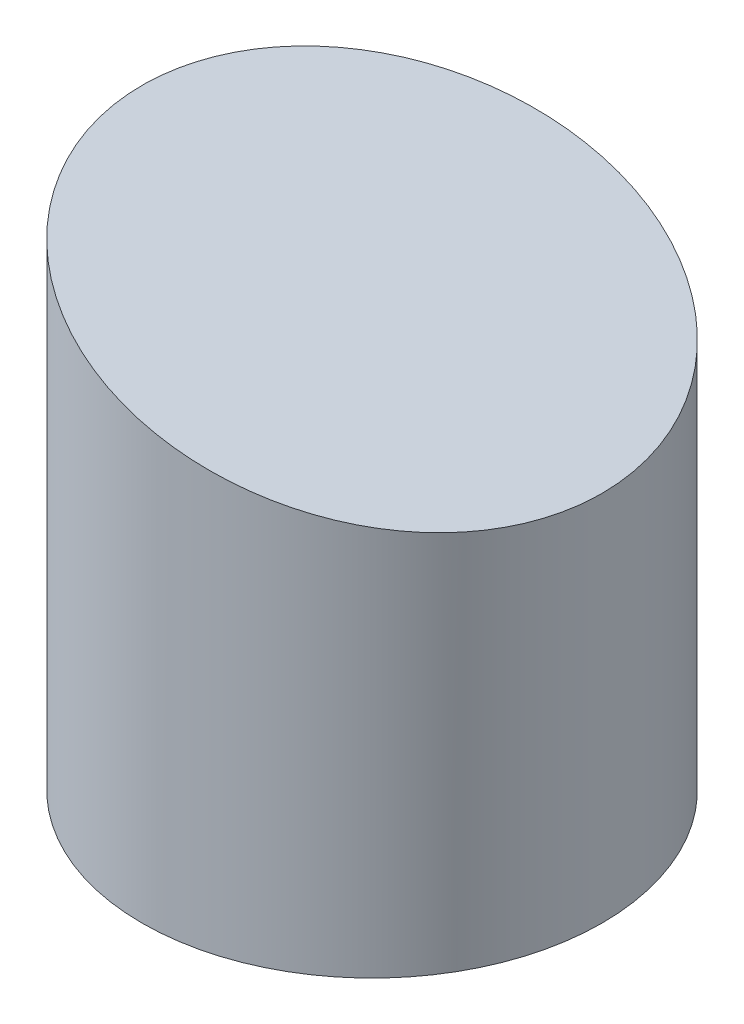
ISO-10303-21;
HEADER;
FILE_DESCRIPTION(('STEP AP214'),'2;1');
FILE_NAME('part.step','',(''),(''),'','','');
FILE_SCHEMA(('AUTOMOTIVE_DESIGN { 1 0 10303 214 1 1 1 1 }'));
ENDSEC;
DATA;
#1=APPLICATION_CONTEXT('core data for automotive mechanical design processes');
#2=APPLICATION_PROTOCOL_DEFINITION('international standard','automotive_design',2000,#1);
#3=PRODUCT_CONTEXT('',#1,'mechanical');
#4=PRODUCT('Part','Part','',(#3));
#5=PRODUCT_RELATED_PRODUCT_CATEGORY('part','',(#4));
#6=PRODUCT_DEFINITION_FORMATION('','',#4);
#7=PRODUCT_DEFINITION_CONTEXT('part definition',#1,'design');
#8=PRODUCT_DEFINITION('design','',#6,#7);
#9=PRODUCT_DEFINITION_SHAPE('','',#8);
#10=(LENGTH_UNIT() NAMED_UNIT(*) SI_UNIT(.MILLI.,.METRE.));
#11=(NAMED_UNIT(*) PLANE_ANGLE_UNIT() SI_UNIT($,.RADIAN.));
#12=(NAMED_UNIT(*) SI_UNIT($,.STERADIAN.) SOLID_ANGLE_UNIT());
#13=UNCERTAINTY_MEASURE_WITH_UNIT(LENGTH_MEASURE(1.E-05),#10,'distance_accuracy_value','');
#14=(GEOMETRIC_REPRESENTATION_CONTEXT(3) GLOBAL_UNCERTAINTY_ASSIGNED_CONTEXT((#13)) GLOBAL_UNIT_ASSIGNED_CONTEXT((#10,
#11,#12)) REPRESENTATION_CONTEXT('',''));
#15=CARTESIAN_POINT('',(0.,0.,0.));
#16=DIRECTION('',(0.,0.,1.));
#17=DIRECTION('',(1.,0.,0.));
#18=AXIS2_PLACEMENT_3D('',#15,#16,#17);
#19=CARTESIAN_POINT('',(0.,35.,0.));
#20=DIRECTION('',(0.,-1.,0.));
#21=DIRECTION('',(0.,0.,-1.));
#22=AXIS2_PLACEMENT_3D('',#19,#20,#21);
#23=CYLINDRICAL_SURFACE('',#22,32.5);
#24=CARTESIAN_POINT('',(0.,-35.,0.));
#25=DIRECTION('',(0.,1.,0.));
#26=DIRECTION('',(0.,0.,1.));
#27=AXIS2_PLACEMENT_3D('',#24,#25,#26);
#28=CIRCLE('',#27,32.5);
#29=CARTESIAN_POINT('',(0.,-35.,32.5));
#30=VERTEX_POINT('',#29);
#31=EDGE_CURVE('E10',#30,#30,#28,.T.);
#32=ORIENTED_EDGE('',*,*,#31,.T.);
#33=EDGE_LOOP('',(#32));
#34=FACE_BOUND('',#33,.T.);
#35=CARTESIAN_POINT('',(0.,26.2916512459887,0.));
#36=DIRECTION('',(0.258819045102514,0.96592582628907,0.));
#37=DIRECTION('',(0.96592582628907,-0.258819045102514,0.));
#38=AXIS2_PLACEMENT_3D('',#35,#36,#37);
#39=ELLIPSE('',#38,33.6464758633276,32.5);
#40=CARTESIAN_POINT('',(32.5,17.5833024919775,0.));
#41=VERTEX_POINT('',#40);
#42=EDGE_CURVE('E36',#41,#41,#39,.T.);
#43=ORIENTED_EDGE('',*,*,#42,.F.);
#44=EDGE_LOOP('',(#43));
#45=FACE_BOUND('',#44,.T.);
#46=ADVANCED_FACE('F30',(#34,#45),#23,.T.);
#47=CARTESIAN_POINT('',(0.,-35.,0.));
#48=DIRECTION('',(0.,1.,0.));
#49=DIRECTION('',(0.,0.,1.));
#50=AXIS2_PLACEMENT_3D('',#47,#48,#49);
#51=PLANE('',#50);
#52=ORIENTED_EDGE('',*,*,#31,.F.);
#53=EDGE_LOOP('',(#52));
#54=FACE_BOUND('',#53,.T.);
#55=ADVANCED_FACE('F45',(#54),#51,.F.);
#56=CARTESIAN_POINT('',(-32.5,35.,185.052750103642));
#57=DIRECTION('',(0.258819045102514,0.96592582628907,0.));
#58=DIRECTION('',(-0.96592582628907,0.258819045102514,0.));
#59=AXIS2_PLACEMENT_3D('',#56,#57,#58);
#60=PLANE('',#59);
#61=ORIENTED_EDGE('',*,*,#42,.T.);
#62=EDGE_LOOP('',(#61));
#63=FACE_BOUND('',#62,.T.);
#64=ADVANCED_FACE('F42',(#63),#60,.T.);
#65=CLOSED_SHELL('',(#46,#55,#64));
#66=MANIFOLD_SOLID_BREP('B2',#65);
#67=ADVANCED_BREP_SHAPE_REPRESENTATION('',(#18,#66),#14);
#68=SHAPE_DEFINITION_REPRESENTATION(#9,#67);
ENDSEC;
END-ISO-10303-21;
